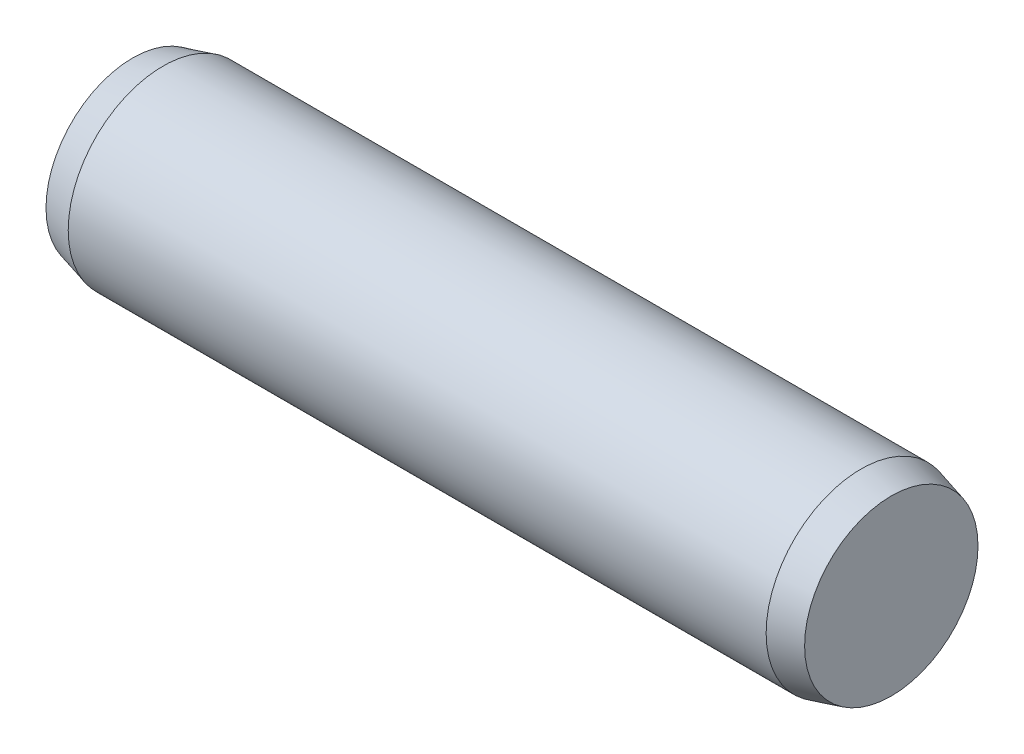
from build123d import *


with BuildPart() as part:
    # Sketch1 → Base-Revolve (revolve)
    with BuildSketch(Plane.XY, mode=Mode.PRIVATE) as base_revolve_sk:
        Polygon((0, 0), (100, 0), (100, 11.42820323), (96, 12.5), (4, 12.5), (0, 11.42820323), align=None)
    revolve(base_revolve_sk.sketch.rotate(Axis((-6.35, 0, 0), (1, 0, 0)), 90), axis=Axis((-6.35, 0, 0), (1, 0, 0)))


solid = part.part
